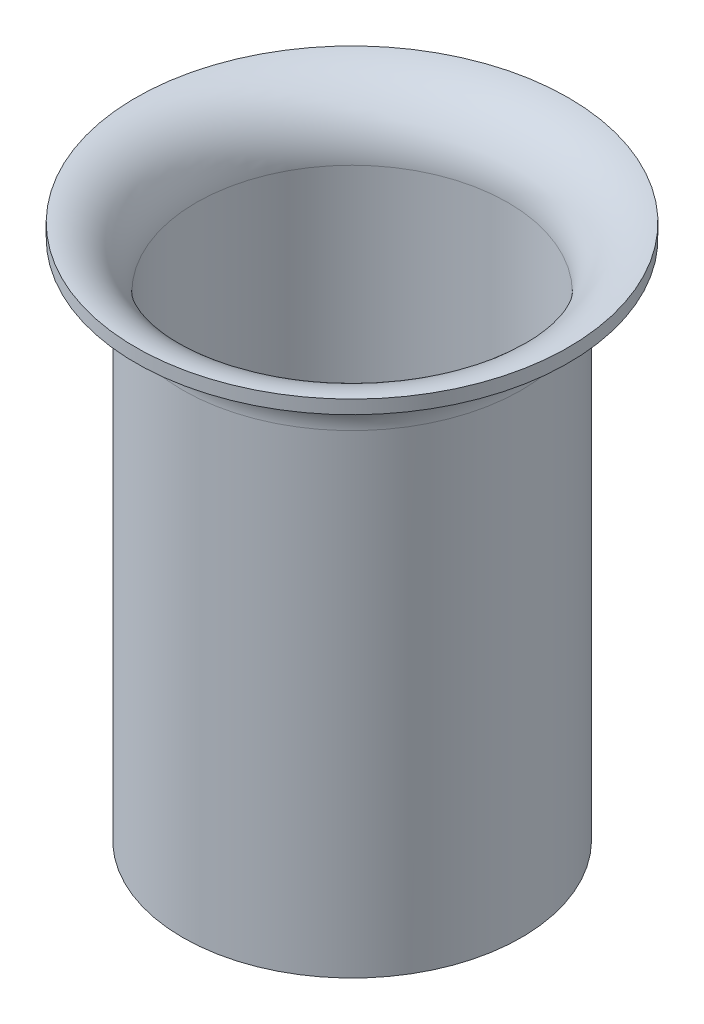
from build123d import *

# Parameters (mm, degrees)
SKETCH1_R      = 12.5
SKETCH1_R_2    = 11.5
EXTRUDE1_DEPTH = 35


with BuildPart() as part:
    # Sketch1 → Extrude1 (new body)
    with BuildSketch(Plane(origin=(0, 0, 0), x_dir=(1, 0, 0), z_dir=(0, 1, 0))):
        with Locations(Location((0, 0, 0), (0, 0, 270))):
            Circle(SKETCH1_R)
        with Locations(Location((0, 0, 0), (0, 0, 270))):
            Circle(SKETCH1_R_2, mode=Mode.SUBTRACT)
    extrude(amount=EXTRUDE1_DEPTH)

    # Sketch2 → Revolve1 (revolve)
    with BuildSketch(Plane.XY, mode=Mode.PRIVATE) as revolve1_sk:
        with BuildLine():
            Line((15.968042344, 38.468042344), (15.968042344, 39.468042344))
            ThreePointArc((15.968042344, 39.468042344), (12.808659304, 38.15938304), (11.5, 35))
            Line((11.5, 35), (12.5, 35))
            ThreePointArc((12.5, 35), (13.515766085, 37.452276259), (15.968042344, 38.468042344))
        make_face()
    revolve(revolve1_sk.sketch.rotate(Axis((0, 35, 0), (0, 1, 0)), 90), axis=Axis((0, 35, 0), (0, 1, 0)))


solid = part.part
